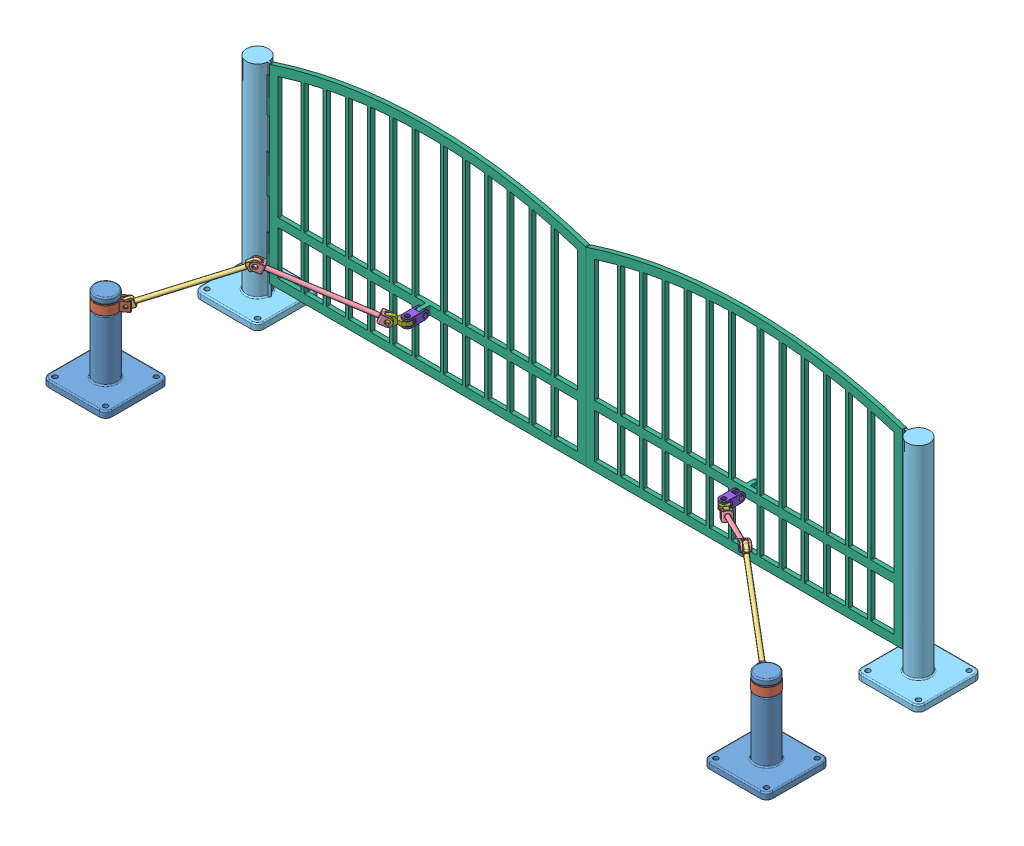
SolidWorks assembly DESN220-51C-MKrueger-Gate Assembly.SLDASM, configuration Default (file format 6000). Lengths in mm.
Overall size (1452.78 469.98 431.8).
16 component instances, 8 part files, 20 mates.
Components (placement in the parent):
- Base Stand-1: Base Stand.SLDPRT [Default] at (28.1285 37.43 121.4273) size (127 165.1 127)
- Arm Connector-1: Arm Connector.SLDPRT [Default] at (28.1285 361.407 121.4273) x (0.799211 0 -0.60105) z (0 -1 0) size (60.58 44.96 18.8)
- Arm-1: Arm.SLDPRT [Default] at (51.981 180.178 103.4889) x (0.722166 0.428381 -0.543108) z (0.60105 0 0.799211) size (222.25 17.17 8.51)
- Connecting-Arm-1: Connecting-Arm.SLDPRT [Default] at (200.0825 268.0301 -7.8915) x (0.739397 -0.379582 -0.556067) z (0.60105 0 0.799211) size (222.25 17.17 17.17)
- Gate Support-1: Gate Support.SLDPRT [Default] at (28.1285 37.43 -183.3727) x (-1 0 0) z (0 0 -1) size (127 419.1 127)
- Gate-1: Gate.SLDPRT [Default] at (373.5198 190.1856 -165.6054) x (0 0 -1) z (1 0 0) size (30.48 431.88 642.38)
- Connector Joint-1: Connector Joint.SLDPRT [Default] at (351.7176 190.1856 -121.9294) x (0.799211 0 -0.60105) z (0.60105 0 0.799211) size (44.45 17.17 17.17)
- Double Joint(1)-1: Double Joint(1).SLDPRT [Default] at (373.5198 190.1856 -138.3258) x (0 0 -1) z (0 1 0) size (44.45 17.17 17.17)
- Double Joint(1)-3: Double Joint(1).SLDPRT [Default] at (1008.5197 190.1856 -138.3258) x (0 0 -1) z (0 -1 0) size (44.45 17.17 17.17)
- Connector Joint-3: Connector Joint.SLDPRT [Default] at (1030.3218 190.1856 -121.9294) x (-0.799211 0 -0.60105) z (0.60105 0 -0.799211) size (44.45 17.17 17.17)
- Arm Connector-3: Arm Connector.SLDPRT [Default] at (1353.911 -0.7935 121.4273) x (-0.799211 0 -0.60105) z (0 1 0) size (60.58 44.96 18.8)
- Arm-3: Arm.SLDPRT [Default] at (1330.0585 180.178 103.4889) x (-0.722166 0.428381 -0.543108) z (0.60105 0 -0.799211) size (222.25 17.17 8.51)
- Gate-3: Gate.SLDPRT [Default] at (1008.5197 190.1856 -201.0295) x (0 0 1) z (-1 0 0) size (30.48 431.88 642.38)
- Gate Support-3: Gate Support.SLDPRT [Default] at (1353.911 37.43 -183.3727) size (127 419.1 127)
- Connecting-Arm-3: Connecting-Arm.SLDPRT [Default] at (1181.957 268.0301 -7.8915) x (-0.739397 -0.379582 -0.556067) z (0.60105 0 -0.799211) size (222.25 17.17 17.17)
- Base Stand-3: Base Stand.SLDPRT [Default] at (1353.911 37.43 121.4273) x (-1 0 0) z (0 0 -1) size (127 165.1 127)
Mates (geometry in assembly coordinates):
- Coincident2: coincident aligned: plane of Base Stand-1 through (78.9285 37.43 172.2273) normal (0 -1 0); plane of Gate Support-1 through (-22.6715 37.43 -234.1727) normal (0 -1 0)
- Concentric1: concentric anti-aligned: cylinder of Base Stand-1 through (28.1285 37.43 121.4273) axis (0 -1 0) radius 12.7; cylinder of Arm Connector-1 through (28.1285 170.907 121.4273) axis (0 1 0) radius 12.954
- Width1: width aligned: plane of Arm Connector-1 through (53.124 189.703 93.81) normal (0 1 0); plane of Arm Connector-1 through (53.124 170.907 93.81) normal (0 -1 0); plane of Base Stand-1 through (40.8285 170.78 121.4273) normal (0 1 0); plane of Base Stand-1 through (50.3535 189.83 121.4273) normal (0 -1 0)
- Width2: width anti-aligned: plane of Arm-1 through (54.4618 180.178 106.7877) normal (0.60105 0 0.799211); plane of Arm-1 through (49.5001 180.178 100.1902) normal (-0.60105 0 -0.799211); plane of Arm Connector-1 through (41.2624 170.907 116.7144) normal (-0.60105 0 -0.799211); plane of Arm Connector-1 through (36.3007 170.907 110.1169) normal (0.60105 0 0.799211)
- Concentric2: concentric anti-aligned: cylinder of Arm Connector-1 through (65.492 180.178 121.4544) axis (-0.60105 0 -0.799211) radius 3.175; cylinder of Arm-1 through (49.5001 180.178 100.1902) axis (0.60105 0 0.799211) radius 4.1275
- Concentric3: concentric anti-aligned: cylinder of Arm-1 through (197.6016 268.0301 -11.1902) axis (0.60105 0 0.799211) radius 4.1275; cylinder of Connecting-Arm-1 through (205.2426 268.0301 -1.0301) axis (-0.60105 0 -0.799211) radius 4.1275
- Width3: width anti-aligned: plane of Arm-1 through (202.5633 268.0301 -4.5927) normal (0.60105 0 0.799211); plane of Arm-1 through (197.6016 268.0301 -11.1902) normal (-0.60105 0 -0.799211); plane of Connecting-Arm-1 through (193.611 263.3462 2.1399) normal (-0.60105 0 -0.799211); plane of Connecting-Arm-1 through (188.6493 263.3462 -4.4576) normal (0.60105 0 0.799211)
- Coincident4: coincident aligned: plane of Base Stand-1 through (91.6285 50.13 172.2273) normal (1 0 0); plane of Gate Support-1 through (91.6285 50.13 -234.1727) normal (1 0 0)
- Distance1: distance = 177.8 mm anti-aligned: plane of Gate Support-1 through (78.9285 50.13 -119.8727) normal (0 0 1); plane of Base Stand-1 through (-22.6715 50.13 57.9273) normal (0 0 -1)
- Concentric4: concentric anti-aligned: cylinder of Gate Support-1 through (52.7665 42.9458 -183.3727) axis (0 1 0) radius 2.54; cylinder of Gate-1 through (52.7665 435.6004 -183.3727) axis (0 -1 0) radius 2.54
- Concentric5: concentric anti-aligned: cylinder of Gate Support-1 through (52.7665 42.9458 -183.3727) axis (0 1 0) radius 2.54; cylinder of Gate-1 through (52.7665 435.6004 -183.3727) axis (0 -1 0) radius 2.54
- Concentric6: concentric anti-aligned: cylinder of Gate Support-1 through (52.7665 42.9458 -183.3727) axis (0 1 0) radius 2.54; cylinder of Gate-1 through (52.7665 435.6004 -183.3727) axis (0 -1 0) radius 2.54
- Width4: width aligned: plane of Connector Joint-1 through (354.1985 190.1856 -118.6307) normal (0.60105 0 0.799211); plane of Connector Joint-1 through (349.2368 190.1856 -125.2281) normal (-0.60105 0 -0.799211); plane of Connecting-Arm-1 through (352.9802 178.9841 -128.0434) normal (0.60105 0 0.799211); plane of Connecting-Arm-1 through (357.9419 178.9841 -121.4459) normal (-0.60105 0 -0.799211)
- Concentric7: concentric aligned: cylinder of Connecting-Arm-1 through (356.8778 190.1856 -115.068) axis (-0.60105 0 -0.799211) radius 4.1275; cylinder of Connector Joint-1 through (354.1985 190.1856 -118.6307) axis (-0.60105 0 -0.799211) radius 4.1275
- Concentric8: concentric anti-aligned: cylinder of Connector Joint-1 through (373.5198 186.0581 -138.3258) axis (0 1 0) radius 4.1275; cylinder of Double Joint(1)-1 through (373.5198 198.7708 -138.3258) axis (0 -1 0) radius 4.1275
- Width5: width anti-aligned: plane of Connector Joint-1 through (373.5198 194.3131 -138.3258) normal (0 1 0); plane of Connector Joint-1 through (373.5198 186.0581 -138.3258) normal (0 -1 0); plane of Double Joint(1)-1 through (382.105 194.3131 -129.7406) normal (0 -1 0); plane of Double Joint(1)-1 through (382.105 186.0581 -129.7406) normal (0 1 0)
- Width7: width anti-aligned: plane of Gate-1 through (377.6473 190.1856 -165.6054) normal (1 0 0); plane of Gate-1 through (369.3923 190.1856 -165.6054) normal (-1 0 0); plane of Double Joint(1)-1 through (377.6473 198.7708 -157.6806) normal (-1 0 0); plane of Double Joint(1)-1 through (369.3923 198.7708 -157.6806) normal (1 0 0)
- Concentric10: concentric anti-aligned: cylinder of Gate-1 through (377.6473 190.1856 -165.6054) axis (-1 0 0) radius 4.1275; cylinder of Double Joint(1)-1 through (364.9346 190.1856 -165.6054) axis (1 0 0) radius 4.1275
- Distance2: distance = 25.4 mm anti-aligned: plane of Gate Support-1 through (-22.6715 50.13 -234.1727) normal (0 1 0); plane of Gate-1 through (691.0198 75.53 -187.5002) normal (0 -1 0)
- Angle1: planar angle = 1.570796 rad aligned: plane of assembly through (0 0 0) normal (1 0 0); plane of Gate-1 through (373.5198 -508.5865 -179.2452) normal (0 0 1)
